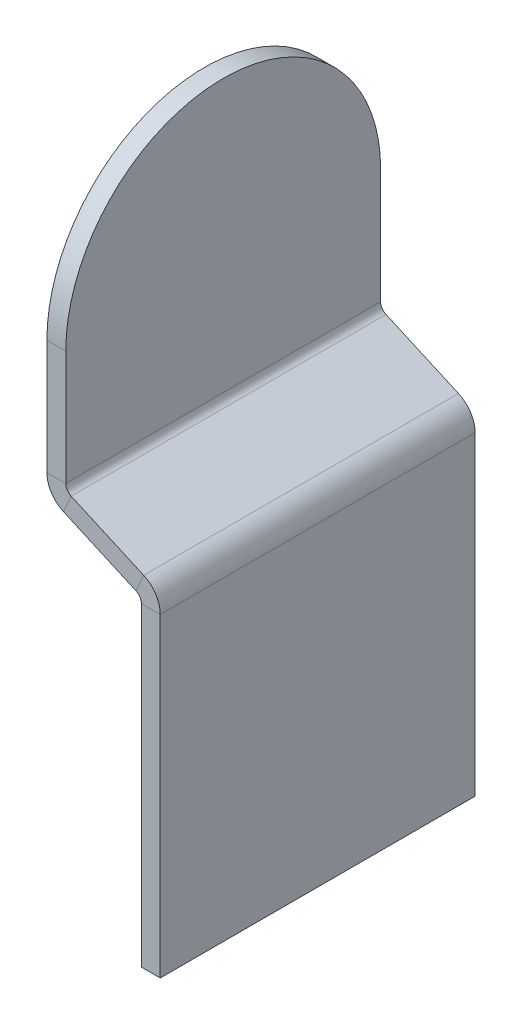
ISO-10303-21;
HEADER;
FILE_DESCRIPTION(('STEP AP214'),'2;1');
FILE_NAME('part.step','',(''),(''),'','','');
FILE_SCHEMA(('AUTOMOTIVE_DESIGN { 1 0 10303 214 1 1 1 1 }'));
ENDSEC;
DATA;
#1=APPLICATION_CONTEXT('core data for automotive mechanical design processes');
#2=APPLICATION_PROTOCOL_DEFINITION('international standard','automotive_design',2000,#1);
#3=PRODUCT_CONTEXT('',#1,'mechanical');
#4=PRODUCT('Part','Part','',(#3));
#5=PRODUCT_RELATED_PRODUCT_CATEGORY('part','',(#4));
#6=PRODUCT_DEFINITION_FORMATION('','',#4);
#7=PRODUCT_DEFINITION_CONTEXT('part definition',#1,'design');
#8=PRODUCT_DEFINITION('design','',#6,#7);
#9=PRODUCT_DEFINITION_SHAPE('','',#8);
#10=(LENGTH_UNIT() NAMED_UNIT(*) SI_UNIT(.MILLI.,.METRE.));
#11=(NAMED_UNIT(*) PLANE_ANGLE_UNIT() SI_UNIT($,.RADIAN.));
#12=(NAMED_UNIT(*) SI_UNIT($,.STERADIAN.) SOLID_ANGLE_UNIT());
#13=UNCERTAINTY_MEASURE_WITH_UNIT(LENGTH_MEASURE(1.E-05),#10,'distance_accuracy_value','');
#14=(GEOMETRIC_REPRESENTATION_CONTEXT(3) GLOBAL_UNCERTAINTY_ASSIGNED_CONTEXT((#13)) GLOBAL_UNIT_ASSIGNED_CONTEXT((#10,
#11,#12)) REPRESENTATION_CONTEXT('',''));
#15=CARTESIAN_POINT('',(0.,0.,0.));
#16=DIRECTION('',(0.,0.,1.));
#17=DIRECTION('',(1.,0.,0.));
#18=AXIS2_PLACEMENT_3D('',#15,#16,#17);
#19=CARTESIAN_POINT('',(24.9639434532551,16.4319155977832,25.4));
#20=DIRECTION('',(0.,0.,1.));
#21=DIRECTION('',(0.406736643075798,0.913545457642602,0.));
#22=AXIS2_PLACEMENT_3D('',#19,#20,#21);
#23=PLANE('',#22);
#24=DIRECTION('',(-0.913545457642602,0.406736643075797,0.));
#25=VECTOR('',#24,1.);
#26=CARTESIAN_POINT('',(24.9639434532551,16.4319155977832,25.4));
#27=LINE('',#26,#25);
#28=CARTESIAN_POINT('',(0.182868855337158,27.4651608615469,25.4));
#29=VERTEX_POINT('',#28);
#30=CARTESIAN_POINT('',(-5.65900221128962,30.0661294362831,25.4));
#31=VERTEX_POINT('',#30);
#32=EDGE_CURVE('E58',#29,#31,#27,.T.);
#33=ORIENTED_EDGE('',*,*,#32,.T.);
#34=DIRECTION('',(-0.406736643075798,-0.913545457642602,0.));
#35=VECTOR('',#34,1.);
#36=CARTESIAN_POINT('',(-5.65900221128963,30.0661294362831,25.4));
#37=LINE('',#36,#35);
#38=CARTESIAN_POINT('',(-6.27886885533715,28.6738861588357,25.4));
#39=VERTEX_POINT('',#38);
#40=EDGE_CURVE('E225',#31,#39,#37,.T.);
#41=ORIENTED_EDGE('',*,*,#40,.T.);
#42=DIRECTION('',(-0.913545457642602,0.406736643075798,0.));
#43=VECTOR('',#42,1.);
#44=CARTESIAN_POINT('',(24.3440768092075,15.0396723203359,25.4));
#45=LINE('',#44,#43);
#46=CARTESIAN_POINT('',(-0.436997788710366,26.0729175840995,25.4));
#47=VERTEX_POINT('',#46);
#48=EDGE_CURVE('E37',#47,#39,#45,.T.);
#49=ORIENTED_EDGE('',*,*,#48,.F.);
#50=DIRECTION('',(-0.406736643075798,-0.913545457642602,0.));
#51=VECTOR('',#50,1.);
#52=CARTESIAN_POINT('',(0.182868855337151,27.4651608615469,25.4));
#53=LINE('',#52,#51);
#54=EDGE_CURVE('E219',#29,#47,#53,.T.);
#55=ORIENTED_EDGE('',*,*,#54,.F.);
#56=EDGE_LOOP('',(#33,#41,#49,#55));
#57=FACE_BOUND('',#56,.T.);
#58=ADVANCED_FACE('F33',(#57),#23,.T.);
#59=CARTESIAN_POINT('',(24.3440768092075,15.0396723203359,25.4));
#60=DIRECTION('',(-0.406736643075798,-0.913545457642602,0.));
#61=DIRECTION('',(0.,0.,1.));
#62=AXIS2_PLACEMENT_3D('',#59,#60,#61);
#63=PLANE('',#62);
#64=ORIENTED_EDGE('',*,*,#48,.T.);
#65=DIRECTION('',(0.,0.,-1.));
#66=VECTOR('',#65,1.);
#67=CARTESIAN_POINT('',(-6.27886885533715,28.6738861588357,25.4));
#68=LINE('',#67,#66);
#69=CARTESIAN_POINT('',(-6.27886885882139,28.67388615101,0.));
#70=VERTEX_POINT('',#69);
#71=EDGE_CURVE('E222',#39,#70,#68,.T.);
#72=ORIENTED_EDGE('',*,*,#71,.T.);
#73=DIRECTION('',(-0.913545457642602,0.406736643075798,0.));
#74=VECTOR('',#73,1.);
#75=CARTESIAN_POINT('',(24.3440768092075,15.0396723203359,0.));
#76=LINE('',#75,#74);
#77=CARTESIAN_POINT('',(-0.436997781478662,26.0729176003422,0.));
#78=VERTEX_POINT('',#77);
#79=EDGE_CURVE('E229',#78,#70,#76,.T.);
#80=ORIENTED_EDGE('',*,*,#79,.F.);
#81=DIRECTION('',(0.,0.,-1.));
#82=VECTOR('',#81,1.);
#83=CARTESIAN_POINT('',(-0.436997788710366,26.0729175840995,25.4));
#84=LINE('',#83,#82);
#85=EDGE_CURVE('E212',#47,#78,#84,.T.);
#86=ORIENTED_EDGE('',*,*,#85,.F.);
#87=EDGE_LOOP('',(#64,#72,#80,#86));
#88=FACE_BOUND('',#87,.T.);
#89=ADVANCED_FACE('F233',(#88),#63,.T.);
#90=CARTESIAN_POINT('',(24.9639434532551,16.4319155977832,25.4));
#91=DIRECTION('',(-0.406736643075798,-0.913545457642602,0.));
#92=DIRECTION('',(0.,0.,1.));
#93=AXIS2_PLACEMENT_3D('',#90,#91,#92);
#94=PLANE('',#93);
#95=DIRECTION('',(0.,0.,-1.));
#96=VECTOR('',#95,1.);
#97=CARTESIAN_POINT('',(-5.65900221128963,30.0661294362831,25.4));
#98=LINE('',#97,#96);
#99=CARTESIAN_POINT('',(-5.65900221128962,30.0661294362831,0.));
#100=VERTEX_POINT('',#99);
#101=EDGE_CURVE('E42',#31,#100,#98,.T.);
#102=ORIENTED_EDGE('',*,*,#101,.F.);
#103=ORIENTED_EDGE('',*,*,#32,.F.);
#104=DIRECTION('',(0.,0.,-1.));
#105=VECTOR('',#104,1.);
#106=CARTESIAN_POINT('',(0.182868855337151,27.4651608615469,25.4));
#107=LINE('',#106,#105);
#108=CARTESIAN_POINT('',(0.182868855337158,27.4651608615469,0.));
#109=VERTEX_POINT('',#108);
#110=EDGE_CURVE('E217',#29,#109,#107,.T.);
#111=ORIENTED_EDGE('',*,*,#110,.T.);
#112=DIRECTION('',(-0.913545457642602,0.406736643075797,0.));
#113=VECTOR('',#112,1.);
#114=CARTESIAN_POINT('',(24.9639434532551,16.4319155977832,0.));
#115=LINE('',#114,#113);
#116=EDGE_CURVE('E50',#109,#100,#115,.T.);
#117=ORIENTED_EDGE('',*,*,#116,.T.);
#118=EDGE_LOOP('',(#102,#103,#111,#117));
#119=FACE_BOUND('',#118,.T.);
#120=ADVANCED_FACE('F279',(#119),#94,.F.);
#121=CARTESIAN_POINT('',(24.9639434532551,16.4319155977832,0.));
#122=DIRECTION('',(0.,0.,1.));
#123=DIRECTION('',(0.406736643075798,0.913545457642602,0.));
#124=AXIS2_PLACEMENT_3D('',#121,#122,#123);
#125=PLANE('',#124);
#126=DIRECTION('',(-0.406736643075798,-0.913545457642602,0.));
#127=VECTOR('',#126,1.);
#128=CARTESIAN_POINT('',(-5.65900221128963,30.0661294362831,0.));
#129=LINE('',#128,#127);
#130=EDGE_CURVE('E12',#100,#70,#129,.T.);
#131=ORIENTED_EDGE('',*,*,#130,.F.);
#132=ORIENTED_EDGE('',*,*,#116,.F.);
#133=DIRECTION('',(-0.406736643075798,-0.913545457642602,0.));
#134=VECTOR('',#133,1.);
#135=CARTESIAN_POINT('',(0.182868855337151,27.4651608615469,0.));
#136=LINE('',#135,#134);
#137=EDGE_CURVE('E215',#109,#78,#136,.T.);
#138=ORIENTED_EDGE('',*,*,#137,.T.);
#139=ORIENTED_EDGE('',*,*,#79,.T.);
#140=EDGE_LOOP('',(#131,#132,#138,#139));
#141=FACE_BOUND('',#140,.T.);
#142=ADVANCED_FACE('F35',(#141),#125,.F.);
#143=CARTESIAN_POINT('',(1.524,0.,25.4));
#144=DIRECTION('',(0.,-1.,0.));
#145=DIRECTION('',(0.,0.,-1.));
#146=AXIS2_PLACEMENT_3D('',#143,#144,#145);
#147=PLANE('',#146);
#148=DIRECTION('',(-1.,0.,0.));
#149=VECTOR('',#148,1.);
#150=CARTESIAN_POINT('',(1.524,0.,0.));
#151=LINE('',#150,#149);
#152=CARTESIAN_POINT('',(1.524,0.,0.));
#153=VERTEX_POINT('',#152);
#154=CARTESIAN_POINT('',(0.,0.,0.));
#155=VERTEX_POINT('',#154);
#156=EDGE_CURVE('E194',#153,#155,#151,.T.);
#157=ORIENTED_EDGE('',*,*,#156,.F.);
#158=DIRECTION('',(0.,0.,-1.));
#159=VECTOR('',#158,1.);
#160=CARTESIAN_POINT('',(1.524,0.,25.4));
#161=LINE('',#160,#159);
#162=CARTESIAN_POINT('',(1.524,0.,25.4));
#163=VERTEX_POINT('',#162);
#164=EDGE_CURVE('E190',#163,#153,#161,.T.);
#165=ORIENTED_EDGE('',*,*,#164,.F.);
#166=DIRECTION('',(-1.,0.,0.));
#167=VECTOR('',#166,1.);
#168=CARTESIAN_POINT('',(1.524,0.,25.4));
#169=LINE('',#168,#167);
#170=CARTESIAN_POINT('',(0.,0.,25.4));
#171=VERTEX_POINT('',#170);
#172=EDGE_CURVE('E204',#163,#171,#169,.T.);
#173=ORIENTED_EDGE('',*,*,#172,.T.);
#174=DIRECTION('',(0.,0.,-1.));
#175=VECTOR('',#174,1.);
#176=CARTESIAN_POINT('',(0.,0.,25.4));
#177=LINE('',#176,#175);
#178=EDGE_CURVE('E202',#171,#155,#177,.T.);
#179=ORIENTED_EDGE('',*,*,#178,.T.);
#180=EDGE_LOOP('',(#157,#165,#173,#179));
#181=FACE_BOUND('',#180,.T.);
#182=ADVANCED_FACE('F315',(#181),#147,.T.);
#183=CARTESIAN_POINT('',(0.,0.,25.4));
#184=DIRECTION('',(-1.,0.,0.));
#185=DIRECTION('',(0.,0.,1.));
#186=AXIS2_PLACEMENT_3D('',#183,#184,#185);
#187=PLANE('',#186);
#188=DIRECTION('',(0.,1.,0.));
#189=VECTOR('',#188,1.);
#190=CARTESIAN_POINT('',(0.,0.,25.4));
#191=LINE('',#190,#189);
#192=CARTESIAN_POINT('',(0.,25.4,25.4));
#193=VERTEX_POINT('',#192);
#194=EDGE_CURVE('E200',#171,#193,#191,.T.);
#195=ORIENTED_EDGE('',*,*,#194,.T.);
#196=DIRECTION('',(0.,0.,-1.));
#197=VECTOR('',#196,1.);
#198=CARTESIAN_POINT('',(0.,25.4,25.4));
#199=LINE('',#198,#197);
#200=CARTESIAN_POINT('',(1.25057651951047E-08,25.4,0.));
#201=VERTEX_POINT('',#200);
#202=EDGE_CURVE('E197',#193,#201,#199,.T.);
#203=ORIENTED_EDGE('',*,*,#202,.T.);
#204=DIRECTION('',(0.,1.,0.));
#205=VECTOR('',#204,1.);
#206=CARTESIAN_POINT('',(0.,0.,0.));
#207=LINE('',#206,#205);
#208=EDGE_CURVE('E192',#155,#201,#207,.T.);
#209=ORIENTED_EDGE('',*,*,#208,.F.);
#210=ORIENTED_EDGE('',*,*,#178,.F.);
#211=EDGE_LOOP('',(#195,#203,#209,#210));
#212=FACE_BOUND('',#211,.T.);
#213=ADVANCED_FACE('F265',(#212),#187,.T.);
#214=CARTESIAN_POINT('',(1.524,0.,0.));
#215=DIRECTION('',(0.,0.,1.));
#216=DIRECTION('',(1.,0.,0.));
#217=AXIS2_PLACEMENT_3D('',#214,#215,#216);
#218=PLANE('',#217);
#219=DIRECTION('',(-1.,0.,0.));
#220=VECTOR('',#219,1.);
#221=CARTESIAN_POINT('',(1.524,25.4,0.));
#222=LINE('',#221,#220);
#223=CARTESIAN_POINT('',(1.524,25.4,0.));
#224=VERTEX_POINT('',#223);
#225=EDGE_CURVE('E207',#224,#201,#222,.T.);
#226=ORIENTED_EDGE('',*,*,#225,.F.);
#227=DIRECTION('',(0.,1.,0.));
#228=VECTOR('',#227,1.);
#229=CARTESIAN_POINT('',(1.524,0.,0.));
#230=LINE('',#229,#228);
#231=EDGE_CURVE('E188',#153,#224,#230,.T.);
#232=ORIENTED_EDGE('',*,*,#231,.F.);
#233=ORIENTED_EDGE('',*,*,#156,.T.);
#234=ORIENTED_EDGE('',*,*,#208,.T.);
#235=EDGE_LOOP('',(#226,#232,#233,#234));
#236=FACE_BOUND('',#235,.T.);
#237=ADVANCED_FACE('F261',(#236),#218,.F.);
#238=CARTESIAN_POINT('',(1.524,0.,25.4));
#239=DIRECTION('',(-1.,0.,0.));
#240=DIRECTION('',(0.,0.,1.));
#241=AXIS2_PLACEMENT_3D('',#238,#239,#240);
#242=PLANE('',#241);
#243=DIRECTION('',(0.,0.,-1.));
#244=VECTOR('',#243,1.);
#245=CARTESIAN_POINT('',(1.524,25.4,25.4));
#246=LINE('',#245,#244);
#247=CARTESIAN_POINT('',(1.524,25.4,25.4));
#248=VERTEX_POINT('',#247);
#249=EDGE_CURVE('E182',#248,#224,#246,.T.);
#250=ORIENTED_EDGE('',*,*,#249,.F.);
#251=DIRECTION('',(0.,1.,0.));
#252=VECTOR('',#251,1.);
#253=CARTESIAN_POINT('',(1.524,0.,25.4));
#254=LINE('',#253,#252);
#255=EDGE_CURVE('E186',#163,#248,#254,.T.);
#256=ORIENTED_EDGE('',*,*,#255,.F.);
#257=ORIENTED_EDGE('',*,*,#164,.T.);
#258=ORIENTED_EDGE('',*,*,#231,.T.);
#259=EDGE_LOOP('',(#250,#256,#257,#258));
#260=FACE_BOUND('',#259,.T.);
#261=ADVANCED_FACE('F330',(#260),#242,.F.);
#262=CARTESIAN_POINT('',(1.524,0.,25.4));
#263=DIRECTION('',(0.,0.,1.));
#264=DIRECTION('',(1.,0.,0.));
#265=AXIS2_PLACEMENT_3D('',#262,#263,#264);
#266=PLANE('',#265);
#267=ORIENTED_EDGE('',*,*,#255,.T.);
#268=DIRECTION('',(-1.,0.,0.));
#269=VECTOR('',#268,1.);
#270=CARTESIAN_POINT('',(1.524,25.4,25.4));
#271=LINE('',#270,#269);
#272=EDGE_CURVE('E183',#248,#193,#271,.T.);
#273=ORIENTED_EDGE('',*,*,#272,.T.);
#274=ORIENTED_EDGE('',*,*,#194,.F.);
#275=ORIENTED_EDGE('',*,*,#172,.F.);
#276=EDGE_LOOP('',(#267,#273,#274,#275));
#277=FACE_BOUND('',#276,.T.);
#278=ADVANCED_FACE('F270',(#277),#266,.T.);
#279=CARTESIAN_POINT('',(-0.736600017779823,25.4,25.4));
#280=DIRECTION('',(0.,0.,-1.));
#281=DIRECTION('',(-1.,0.,0.));
#282=AXIS2_PLACEMENT_3D('',#279,#280,#281);
#283=PLANE('',#282);
#284=ORIENTED_EDGE('',*,*,#272,.F.);
#285=CARTESIAN_POINT('',(-0.7366,25.4,25.4));
#286=DIRECTION('',(0.,0.,-1.));
#287=DIRECTION('',(-1.,0.,0.));
#288=AXIS2_PLACEMENT_3D('',#285,#286,#287);
#289=CIRCLE('',#288,2.26060001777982);
#290=EDGE_CURVE('E170',#248,#29,#289,.F.);
#291=ORIENTED_EDGE('',*,*,#290,.T.);
#292=ORIENTED_EDGE('',*,*,#54,.T.);
#293=CARTESIAN_POINT('',(-0.736600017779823,25.4,25.4));
#294=DIRECTION('',(0.,0.,1.));
#295=DIRECTION('',(1.,0.,0.));
#296=AXIS2_PLACEMENT_3D('',#293,#294,#295);
#297=CIRCLE('',#296,0.736600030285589);
#298=EDGE_CURVE('E174',#193,#47,#297,.T.);
#299=ORIENTED_EDGE('',*,*,#298,.F.);
#300=EDGE_LOOP('',(#284,#291,#292,#299));
#301=FACE_BOUND('',#300,.T.);
#302=ADVANCED_FACE('F275',(#301),#283,.F.);
#303=CARTESIAN_POINT('',(-0.736600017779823,25.4,0.));
#304=DIRECTION('',(0.,0.,1.));
#305=DIRECTION('',(1.,0.,0.));
#306=AXIS2_PLACEMENT_3D('',#303,#304,#305);
#307=PLANE('',#306);
#308=ORIENTED_EDGE('',*,*,#137,.F.);
#309=CARTESIAN_POINT('',(-0.7366,25.4,0.));
#310=DIRECTION('',(0.,0.,-1.));
#311=DIRECTION('',(-1.,0.,0.));
#312=AXIS2_PLACEMENT_3D('',#309,#310,#311);
#313=CIRCLE('',#312,2.26060001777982);
#314=EDGE_CURVE('E171',#109,#224,#313,.T.);
#315=ORIENTED_EDGE('',*,*,#314,.T.);
#316=ORIENTED_EDGE('',*,*,#225,.T.);
#317=CARTESIAN_POINT('',(-0.736600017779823,25.4,0.));
#318=DIRECTION('',(0.,0.,-1.));
#319=DIRECTION('',(1.,0.,0.));
#320=AXIS2_PLACEMENT_3D('',#317,#318,#319);
#321=CIRCLE('',#320,0.736600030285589);
#322=EDGE_CURVE('E179',#78,#201,#321,.T.);
#323=ORIENTED_EDGE('',*,*,#322,.F.);
#324=EDGE_LOOP('',(#308,#315,#316,#323));
#325=FACE_BOUND('',#324,.T.);
#326=ADVANCED_FACE('F256',(#325),#307,.F.);
#327=CARTESIAN_POINT('',(-0.7366,25.4,38.2041675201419));
#328=DIRECTION('',(0.,0.,-1.));
#329=DIRECTION('',(-1.,0.,0.));
#330=AXIS2_PLACEMENT_3D('',#327,#328,#329);
#331=CYLINDRICAL_SURFACE('',#330,0.736600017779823);
#332=ORIENTED_EDGE('',*,*,#322,.T.);
#333=ORIENTED_EDGE('',*,*,#202,.F.);
#334=ORIENTED_EDGE('',*,*,#298,.T.);
#335=ORIENTED_EDGE('',*,*,#85,.T.);
#336=EDGE_LOOP('',(#332,#333,#334,#335));
#337=FACE_BOUND('',#336,.T.);
#338=ADVANCED_FACE('F252',(#337),#331,.F.);
#339=CARTESIAN_POINT('',(-0.7366,25.4,38.2041675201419));
#340=DIRECTION('',(0.,0.,-1.));
#341=DIRECTION('',(-1.,0.,0.));
#342=AXIS2_PLACEMENT_3D('',#339,#340,#341);
#343=CYLINDRICAL_SURFACE('',#342,2.26060001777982);
#344=ORIENTED_EDGE('',*,*,#314,.F.);
#345=ORIENTED_EDGE('',*,*,#110,.F.);
#346=ORIENTED_EDGE('',*,*,#290,.F.);
#347=ORIENTED_EDGE('',*,*,#249,.T.);
#348=EDGE_LOOP('',(#344,#345,#346,#347));
#349=FACE_BOUND('',#348,.T.);
#350=ADVANCED_FACE('F278',(#349),#343,.T.);
#351=CARTESIAN_POINT('',(-5.35939999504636,30.7390470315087,25.4));
#352=DIRECTION('',(0.,0.,1.));
#353=DIRECTION('',(1.,0.,0.));
#354=AXIS2_PLACEMENT_3D('',#351,#352,#353);
#355=PLANE('',#354);
#356=ORIENTED_EDGE('',*,*,#40,.F.);
#357=CARTESIAN_POINT('',(-5.3594,30.7390470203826,25.4));
#358=DIRECTION('',(0.,0.,-1.));
#359=DIRECTION('',(-1.,0.,0.));
#360=AXIS2_PLACEMENT_3D('',#357,#358,#359);
#361=CIRCLE('',#360,0.736600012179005);
#362=CARTESIAN_POINT('',(-6.09600000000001,30.7390470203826,25.4));
#363=VERTEX_POINT('',#362);
#364=EDGE_CURVE('E144',#31,#363,#361,.T.);
#365=ORIENTED_EDGE('',*,*,#364,.T.);
#366=DIRECTION('',(-1.,0.,0.));
#367=VECTOR('',#366,1.);
#368=CARTESIAN_POINT('',(-6.09600000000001,30.7390470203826,25.4));
#369=LINE('',#368,#367);
#370=CARTESIAN_POINT('',(-7.62000000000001,30.7390470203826,25.4));
#371=VERTEX_POINT('',#370);
#372=EDGE_CURVE('E150',#363,#371,#369,.T.);
#373=ORIENTED_EDGE('',*,*,#372,.T.);
#374=CARTESIAN_POINT('',(-5.35939999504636,30.7390470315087,25.4));
#375=DIRECTION('',(0.,0.,-1.));
#376=DIRECTION('',(-1.,0.,0.));
#377=AXIS2_PLACEMENT_3D('',#374,#375,#376);
#378=CIRCLE('',#377,2.26060002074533);
#379=EDGE_CURVE('E162',#39,#371,#378,.T.);
#380=ORIENTED_EDGE('',*,*,#379,.F.);
#381=EDGE_LOOP('',(#356,#365,#373,#380));
#382=FACE_BOUND('',#381,.T.);
#383=ADVANCED_FACE('F240',(#382),#355,.T.);
#384=CARTESIAN_POINT('',(-5.35939999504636,30.7390470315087,0.));
#385=DIRECTION('',(0.,0.,-1.));
#386=DIRECTION('',(-1.,0.,0.));
#387=AXIS2_PLACEMENT_3D('',#384,#385,#386);
#388=PLANE('',#387);
#389=DIRECTION('',(-1.,0.,0.));
#390=VECTOR('',#389,1.);
#391=CARTESIAN_POINT('',(-6.09600000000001,30.7390470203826,0.));
#392=LINE('',#391,#390);
#393=CARTESIAN_POINT('',(-6.09600000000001,30.7390470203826,0.));
#394=VERTEX_POINT('',#393);
#395=CARTESIAN_POINT('',(-7.62000001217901,30.7390470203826,0.));
#396=VERTEX_POINT('',#395);
#397=EDGE_CURVE('E130',#394,#396,#392,.T.);
#398=ORIENTED_EDGE('',*,*,#397,.F.);
#399=CARTESIAN_POINT('',(-5.3594,30.7390470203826,0.));
#400=DIRECTION('',(0.,0.,-1.));
#401=DIRECTION('',(-1.,0.,0.));
#402=AXIS2_PLACEMENT_3D('',#399,#400,#401);
#403=CIRCLE('',#402,0.736600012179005);
#404=EDGE_CURVE('E159',#394,#100,#403,.F.);
#405=ORIENTED_EDGE('',*,*,#404,.T.);
#406=ORIENTED_EDGE('',*,*,#130,.T.);
#407=CARTESIAN_POINT('',(-5.35939999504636,30.7390470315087,0.));
#408=DIRECTION('',(0.,0.,1.));
#409=DIRECTION('',(-1.,0.,0.));
#410=AXIS2_PLACEMENT_3D('',#407,#408,#409);
#411=CIRCLE('',#410,2.26060002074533);
#412=EDGE_CURVE('E167',#396,#70,#411,.T.);
#413=ORIENTED_EDGE('',*,*,#412,.F.);
#414=EDGE_LOOP('',(#398,#405,#406,#413));
#415=FACE_BOUND('',#414,.T.);
#416=ADVANCED_FACE('F246',(#415),#388,.T.);
#417=CARTESIAN_POINT('',(-5.3594,30.7390470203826,38.280710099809));
#418=DIRECTION('',(0.,0.,-1.));
#419=DIRECTION('',(-1.,0.,0.));
#420=AXIS2_PLACEMENT_3D('',#417,#418,#419);
#421=CYLINDRICAL_SURFACE('',#420,2.26060001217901);
#422=ORIENTED_EDGE('',*,*,#412,.T.);
#423=ORIENTED_EDGE('',*,*,#71,.F.);
#424=ORIENTED_EDGE('',*,*,#379,.T.);
#425=DIRECTION('',(0.,0.,-1.));
#426=VECTOR('',#425,1.);
#427=CARTESIAN_POINT('',(-7.62000000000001,30.7390470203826,25.4));
#428=LINE('',#427,#426);
#429=EDGE_CURVE('E154',#371,#396,#428,.T.);
#430=ORIENTED_EDGE('',*,*,#429,.T.);
#431=EDGE_LOOP('',(#422,#423,#424,#430));
#432=FACE_BOUND('',#431,.T.);
#433=ADVANCED_FACE('F243',(#432),#421,.T.);
#434=CARTESIAN_POINT('',(-5.3594,30.7390470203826,38.280710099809));
#435=DIRECTION('',(0.,0.,-1.));
#436=DIRECTION('',(-1.,0.,0.));
#437=AXIS2_PLACEMENT_3D('',#434,#435,#436);
#438=CYLINDRICAL_SURFACE('',#437,0.736600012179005);
#439=ORIENTED_EDGE('',*,*,#404,.F.);
#440=DIRECTION('',(0.,0.,-1.));
#441=VECTOR('',#440,1.);
#442=CARTESIAN_POINT('',(-6.09600000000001,30.7390470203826,25.4));
#443=LINE('',#442,#441);
#444=EDGE_CURVE('E284',#363,#394,#443,.T.);
#445=ORIENTED_EDGE('',*,*,#444,.F.);
#446=ORIENTED_EDGE('',*,*,#364,.F.);
#447=ORIENTED_EDGE('',*,*,#101,.T.);
#448=EDGE_LOOP('',(#439,#445,#446,#447));
#449=FACE_BOUND('',#448,.T.);
#450=ADVANCED_FACE('F281',(#449),#438,.F.);
#451=CARTESIAN_POINT('',(-7.62000000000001,39.992564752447,12.7));
#452=DIRECTION('',(1.,0.,0.));
#453=DIRECTION('',(0.,0.,-1.));
#454=AXIS2_PLACEMENT_3D('',#451,#452,#453);
#455=CYLINDRICAL_SURFACE('',#454,12.7);
#456=CARTESIAN_POINT('',(-6.09600000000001,39.992564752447,12.7));
#457=DIRECTION('',(1.,0.,0.));
#458=DIRECTION('',(0.,0.,1.));
#459=AXIS2_PLACEMENT_3D('',#456,#457,#458);
#460=CIRCLE('',#459,12.7);
#461=CARTESIAN_POINT('',(-6.09600000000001,39.992564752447,0.));
#462=VERTEX_POINT('',#461);
#463=CARTESIAN_POINT('',(-6.09600000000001,39.992564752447,25.4));
#464=VERTEX_POINT('',#463);
#465=EDGE_CURVE('E143',#462,#464,#460,.T.);
#466=ORIENTED_EDGE('',*,*,#465,.F.);
#467=DIRECTION('',(1.,0.,0.));
#468=VECTOR('',#467,1.);
#469=CARTESIAN_POINT('',(-7.62000000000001,39.992564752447,0.));
#470=LINE('',#469,#468);
#471=CARTESIAN_POINT('',(-7.62000000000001,39.992564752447,0.));
#472=VERTEX_POINT('',#471);
#473=EDGE_CURVE('E128',#472,#462,#470,.T.);
#474=ORIENTED_EDGE('',*,*,#473,.F.);
#475=CARTESIAN_POINT('',(-7.62000000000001,39.992564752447,12.7));
#476=DIRECTION('',(1.,0.,0.));
#477=DIRECTION('',(0.,0.,1.));
#478=AXIS2_PLACEMENT_3D('',#475,#476,#477);
#479=CIRCLE('',#478,12.7);
#480=CARTESIAN_POINT('',(-7.62000000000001,39.992564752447,25.4));
#481=VERTEX_POINT('',#480);
#482=EDGE_CURVE('E140',#472,#481,#479,.T.);
#483=ORIENTED_EDGE('',*,*,#482,.T.);
#484=DIRECTION('',(1.,0.,0.));
#485=VECTOR('',#484,1.);
#486=CARTESIAN_POINT('',(-7.62000000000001,39.992564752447,25.4));
#487=LINE('',#486,#485);
#488=EDGE_CURVE('E149',#481,#464,#487,.T.);
#489=ORIENTED_EDGE('',*,*,#488,.T.);
#490=EDGE_LOOP('',(#466,#474,#483,#489));
#491=FACE_BOUND('',#490,.T.);
#492=ADVANCED_FACE('F138',(#491),#455,.T.);
#493=CARTESIAN_POINT('',(-7.62000000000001,-4.50820353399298,25.4));
#494=DIRECTION('',(-1.,0.,0.));
#495=DIRECTION('',(0.,0.,1.));
#496=AXIS2_PLACEMENT_3D('',#493,#494,#495);
#497=PLANE('',#496);
#498=ORIENTED_EDGE('',*,*,#429,.F.);
#499=DIRECTION('',(0.,1.,0.));
#500=VECTOR('',#499,1.);
#501=CARTESIAN_POINT('',(-7.62000000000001,-4.50820353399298,25.4));
#502=LINE('',#501,#500);
#503=EDGE_CURVE('E148',#371,#481,#502,.T.);
#504=ORIENTED_EDGE('',*,*,#503,.T.);
#505=ORIENTED_EDGE('',*,*,#482,.F.);
#506=DIRECTION('',(0.,1.,0.));
#507=VECTOR('',#506,1.);
#508=CARTESIAN_POINT('',(-7.62000000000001,-4.50820353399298,0.));
#509=LINE('',#508,#507);
#510=EDGE_CURVE('E125',#396,#472,#509,.T.);
#511=ORIENTED_EDGE('',*,*,#510,.F.);
#512=EDGE_LOOP('',(#498,#504,#505,#511));
#513=FACE_BOUND('',#512,.T.);
#514=ADVANCED_FACE('F146',(#513),#497,.T.);
#515=CARTESIAN_POINT('',(-6.09600000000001,-4.50820353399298,25.4));
#516=DIRECTION('',(0.,0.,1.));
#517=DIRECTION('',(1.,0.,0.));
#518=AXIS2_PLACEMENT_3D('',#515,#516,#517);
#519=PLANE('',#518);
#520=ORIENTED_EDGE('',*,*,#372,.F.);
#521=DIRECTION('',(0.,1.,0.));
#522=VECTOR('',#521,1.);
#523=CARTESIAN_POINT('',(-6.09600000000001,-4.50820353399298,25.4));
#524=LINE('',#523,#522);
#525=EDGE_CURVE('E287',#363,#464,#524,.T.);
#526=ORIENTED_EDGE('',*,*,#525,.T.);
#527=ORIENTED_EDGE('',*,*,#488,.F.);
#528=ORIENTED_EDGE('',*,*,#503,.F.);
#529=EDGE_LOOP('',(#520,#526,#527,#528));
#530=FACE_BOUND('',#529,.T.);
#531=ADVANCED_FACE('F295',(#530),#519,.T.);
#532=CARTESIAN_POINT('',(-6.09600000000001,-4.50820353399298,25.4));
#533=DIRECTION('',(-1.,0.,0.));
#534=DIRECTION('',(0.,0.,1.));
#535=AXIS2_PLACEMENT_3D('',#532,#533,#534);
#536=PLANE('',#535);
#537=ORIENTED_EDGE('',*,*,#525,.F.);
#538=ORIENTED_EDGE('',*,*,#444,.T.);
#539=DIRECTION('',(0.,1.,0.));
#540=VECTOR('',#539,1.);
#541=CARTESIAN_POINT('',(-6.09600000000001,-4.50820353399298,0.));
#542=LINE('',#541,#540);
#543=EDGE_CURVE('E286',#394,#462,#542,.T.);
#544=ORIENTED_EDGE('',*,*,#543,.T.);
#545=ORIENTED_EDGE('',*,*,#465,.T.);
#546=EDGE_LOOP('',(#537,#538,#544,#545));
#547=FACE_BOUND('',#546,.T.);
#548=ADVANCED_FACE('F293',(#547),#536,.F.);
#549=CARTESIAN_POINT('',(-6.09600000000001,-4.50820353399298,0.));
#550=DIRECTION('',(0.,0.,1.));
#551=DIRECTION('',(1.,0.,0.));
#552=AXIS2_PLACEMENT_3D('',#549,#550,#551);
#553=PLANE('',#552);
#554=ORIENTED_EDGE('',*,*,#543,.F.);
#555=ORIENTED_EDGE('',*,*,#397,.T.);
#556=ORIENTED_EDGE('',*,*,#510,.T.);
#557=ORIENTED_EDGE('',*,*,#473,.T.);
#558=EDGE_LOOP('',(#554,#555,#556,#557));
#559=FACE_BOUND('',#558,.T.);
#560=ADVANCED_FACE('F127',(#559),#553,.F.);
#561=CLOSED_SHELL('',(#58,#89,#120,#142,#182,#213,#237,#261,#278,#302,#326,#338,#350,#383,#416,
#433,#450,#492,#514,#531,#548,#560));
#562=MANIFOLD_SOLID_BREP('B2',#561);
#563=ADVANCED_BREP_SHAPE_REPRESENTATION('',(#18,#562),#14);
#564=SHAPE_DEFINITION_REPRESENTATION(#9,#563);
ENDSEC;
END-ISO-10303-21;
